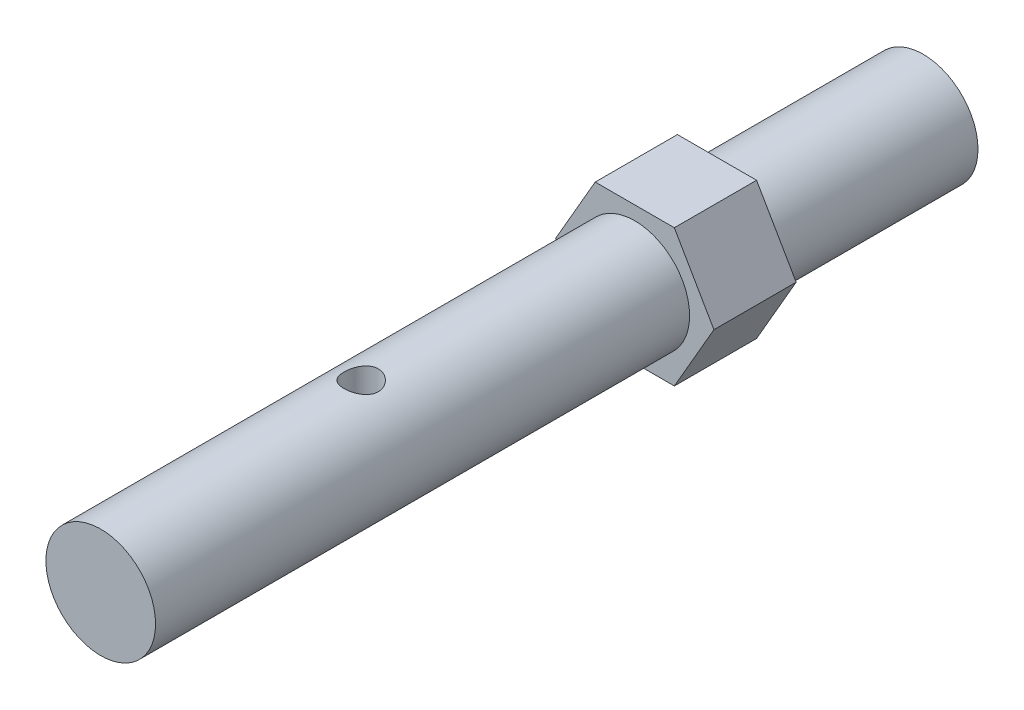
from build123d import *

# Parameters (mm, degrees)
SKETCH1_R               = 3.175
BOSS_EXTRUDE1_DEPTH     = 23.8125
CUT_EXTRUDE1_DEPTH      = 25.232135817
CUT_EXTRUDE1_DEPTH_BACK = 25.232135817
SKETCH3_R               = 0.9921875
BOSS_EXTRUDE2_DEPTH     = 4.7625


with BuildPart() as part:
    # Sketch1 → Boss-Extrude1 (new, symmetric)
    with BuildSketch(Plane.XY):
        Circle(SKETCH1_R)
    extrude(amount=BOSS_EXTRUDE1_DEPTH, both=True)

    # Sketch3 → Cut-Extrude1 (cut, two sides: drawn at the far end of the back side and taken through both)
    with BuildSketch(Plane(origin=(0, 0, 0), x_dir=(1, 0, 0), z_dir=(0, 1, 0)).offset(-CUT_EXTRUDE1_DEPTH_BACK)):
        with Locations(Location((0, -8.73125, 0), (0, 0, 270))):
            Circle(SKETCH3_R)
    extrude(amount=CUT_EXTRUDE1_DEPTH + CUT_EXTRUDE1_DEPTH_BACK, mode=Mode.SUBTRACT)

    # Sketch2 → Boss-Extrude2 (add)
    with BuildSketch(Plane.XY.offset(-7.112)):
        Polygon((4.582717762, 0), (2.291358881, 3.96875), (-2.291358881, 3.96875), (-4.582717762, 0), (-2.291358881, -3.96875), (2.291358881, -3.96875), align=None)
    extrude(amount=-BOSS_EXTRUDE2_DEPTH)


solid = part.part
